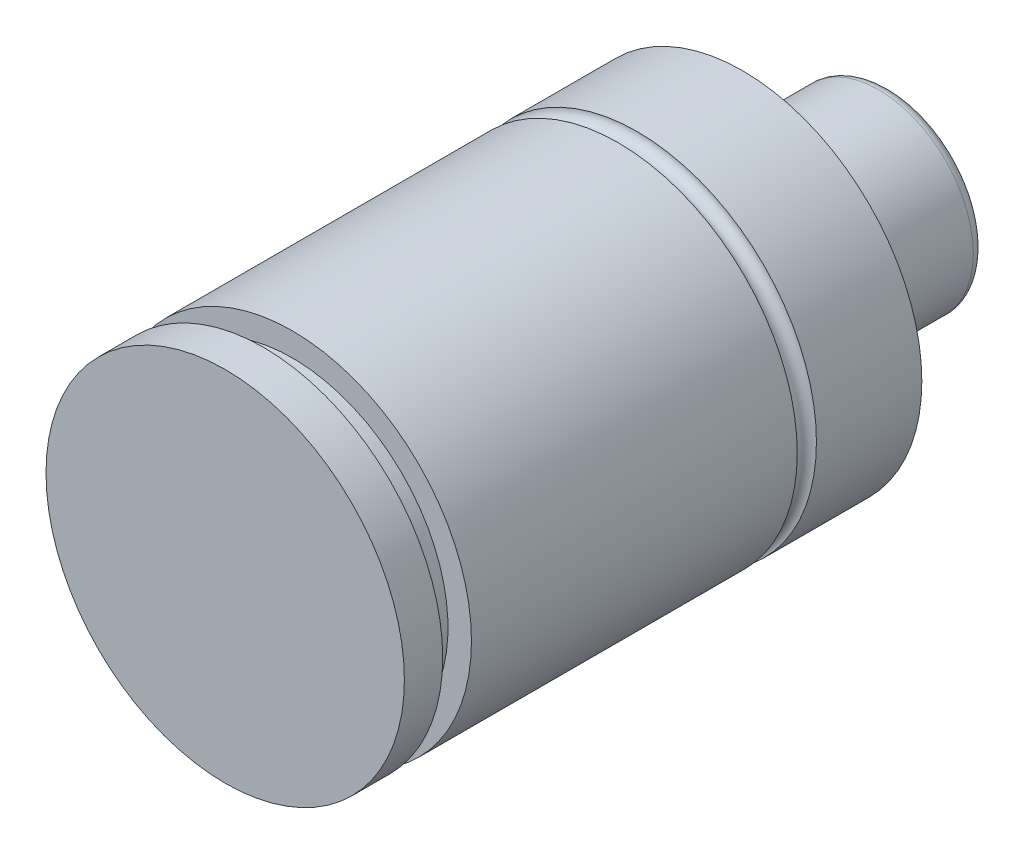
ISO-10303-21;
HEADER;
FILE_DESCRIPTION(('STEP AP214'),'2;1');
FILE_NAME('part.step','',(''),(''),'','','');
FILE_SCHEMA(('AUTOMOTIVE_DESIGN { 1 0 10303 214 1 1 1 1 }'));
ENDSEC;
DATA;
#1=APPLICATION_CONTEXT('core data for automotive mechanical design processes');
#2=APPLICATION_PROTOCOL_DEFINITION('international standard','automotive_design',2000,#1);
#3=PRODUCT_CONTEXT('',#1,'mechanical');
#4=PRODUCT('Part','Part','',(#3));
#5=PRODUCT_RELATED_PRODUCT_CATEGORY('part','',(#4));
#6=PRODUCT_DEFINITION_FORMATION('','',#4);
#7=PRODUCT_DEFINITION_CONTEXT('part definition',#1,'design');
#8=PRODUCT_DEFINITION('design','',#6,#7);
#9=PRODUCT_DEFINITION_SHAPE('','',#8);
#10=(LENGTH_UNIT() NAMED_UNIT(*) SI_UNIT(.MILLI.,.METRE.));
#11=(NAMED_UNIT(*) PLANE_ANGLE_UNIT() SI_UNIT($,.RADIAN.));
#12=(NAMED_UNIT(*) SI_UNIT($,.STERADIAN.) SOLID_ANGLE_UNIT());
#13=UNCERTAINTY_MEASURE_WITH_UNIT(LENGTH_MEASURE(1.E-05),#10,'distance_accuracy_value','');
#14=(GEOMETRIC_REPRESENTATION_CONTEXT(3) GLOBAL_UNCERTAINTY_ASSIGNED_CONTEXT((#13)) GLOBAL_UNIT_ASSIGNED_CONTEXT((#10,
#11,#12)) REPRESENTATION_CONTEXT('',''));
#15=CARTESIAN_POINT('',(0.,0.,0.));
#16=DIRECTION('',(0.,0.,1.));
#17=DIRECTION('',(1.,0.,0.));
#18=AXIS2_PLACEMENT_3D('',#15,#16,#17);
#19=CARTESIAN_POINT('',(0.,0.,-88.0737961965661));
#20=DIRECTION('',(0.,0.,-1.));
#21=DIRECTION('',(-1.,0.,0.));
#22=AXIS2_PLACEMENT_3D('',#19,#20,#21);
#23=CYLINDRICAL_SURFACE('',#22,10.033);
#24=CARTESIAN_POINT('',(0.,0.,-69.2912));
#25=DIRECTION('',(0.,0.,-1.));
#26=DIRECTION('',(-1.,0.,0.));
#27=AXIS2_PLACEMENT_3D('',#24,#25,#26);
#28=CIRCLE('',#27,10.033);
#29=CARTESIAN_POINT('',(-10.033,0.,-69.2912));
#30=VERTEX_POINT('',#29);
#31=EDGE_CURVE('E10',#30,#30,#28,.T.);
#32=ORIENTED_EDGE('',*,*,#31,.F.);
#33=EDGE_LOOP('',(#32));
#34=FACE_BOUND('',#33,.T.);
#35=CARTESIAN_POINT('',(0.,0.,-54.864));
#36=DIRECTION('',(0.,0.,-1.));
#37=DIRECTION('',(-1.,0.,0.));
#38=AXIS2_PLACEMENT_3D('',#35,#36,#37);
#39=CIRCLE('',#38,10.033);
#40=CARTESIAN_POINT('',(-10.033,0.,-54.864));
#41=VERTEX_POINT('',#40);
#42=EDGE_CURVE('E78',#41,#41,#39,.T.);
#43=ORIENTED_EDGE('',*,*,#42,.T.);
#44=EDGE_LOOP('',(#43));
#45=FACE_BOUND('',#44,.T.);
#46=ADVANCED_FACE('F41',(#34,#45),#23,.T.);
#47=CARTESIAN_POINT('',(0.,0.,-69.2912));
#48=DIRECTION('',(0.,0.,-1.));
#49=DIRECTION('',(-1.,0.,0.));
#50=AXIS2_PLACEMENT_3D('',#47,#48,#49);
#51=TOROIDAL_SURFACE('',#50,8.8392,1.19379999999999);
#52=CARTESIAN_POINT('',(0.,0.,-70.485));
#53=DIRECTION('',(0.,0.,-1.));
#54=DIRECTION('',(-1.,0.,0.));
#55=AXIS2_PLACEMENT_3D('',#52,#53,#54);
#56=CIRCLE('',#55,8.8392);
#57=CARTESIAN_POINT('',(-8.8392,0.,-70.485));
#58=VERTEX_POINT('',#57);
#59=EDGE_CURVE('E47',#58,#58,#56,.T.);
#60=ORIENTED_EDGE('',*,*,#59,.F.);
#61=EDGE_LOOP('',(#60));
#62=FACE_BOUND('',#61,.T.);
#63=ORIENTED_EDGE('',*,*,#31,.T.);
#64=EDGE_LOOP('',(#63));
#65=FACE_BOUND('',#64,.T.);
#66=ADVANCED_FACE('F138',(#62,#65),#51,.T.);
#67=CARTESIAN_POINT('',(-8.8392,0.,-70.485));
#68=DIRECTION('',(0.,0.,1.));
#69=DIRECTION('',(1.,0.,0.));
#70=AXIS2_PLACEMENT_3D('',#67,#68,#69);
#71=PLANE('',#70);
#72=ORIENTED_EDGE('',*,*,#59,.T.);
#73=EDGE_LOOP('',(#72));
#74=FACE_BOUND('',#73,.T.);
#75=ADVANCED_FACE('F133',(#74),#71,.F.);
#76=CARTESIAN_POINT('',(0.,0.,0.));
#77=DIRECTION('',(0.,0.,-1.));
#78=DIRECTION('',(-1.,0.,0.));
#79=AXIS2_PLACEMENT_3D('',#76,#77,#78);
#80=PLANE('',#79);
#81=CARTESIAN_POINT('',(0.,0.,0.));
#82=DIRECTION('',(0.,0.,-1.));
#83=DIRECTION('',(-1.,0.,0.));
#84=AXIS2_PLACEMENT_3D('',#81,#82,#83);
#85=CIRCLE('',#84,18.9992);
#86=CARTESIAN_POINT('',(-18.9992,0.,0.));
#87=VERTEX_POINT('',#86);
#88=EDGE_CURVE('E51',#87,#87,#85,.T.);
#89=ORIENTED_EDGE('',*,*,#88,.F.);
#90=EDGE_LOOP('',(#89));
#91=FACE_BOUND('',#90,.T.);
#92=ADVANCED_FACE('F128',(#91),#80,.F.);
#93=CARTESIAN_POINT('',(0.,0.,-88.0737961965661));
#94=DIRECTION('',(0.,0.,-1.));
#95=DIRECTION('',(-1.,0.,0.));
#96=AXIS2_PLACEMENT_3D('',#93,#94,#95);
#97=CYLINDRICAL_SURFACE('',#96,18.9992);
#98=CARTESIAN_POINT('',(0.,0.,-4.064));
#99=DIRECTION('',(0.,0.,-1.));
#100=DIRECTION('',(-1.,0.,0.));
#101=AXIS2_PLACEMENT_3D('',#98,#99,#100);
#102=CIRCLE('',#101,18.9992);
#103=CARTESIAN_POINT('',(-18.9992,0.,-4.064));
#104=VERTEX_POINT('',#103);
#105=EDGE_CURVE('E55',#104,#104,#102,.T.);
#106=ORIENTED_EDGE('',*,*,#105,.F.);
#107=EDGE_LOOP('',(#106));
#108=FACE_BOUND('',#107,.T.);
#109=ORIENTED_EDGE('',*,*,#88,.T.);
#110=EDGE_LOOP('',(#109));
#111=FACE_BOUND('',#110,.T.);
#112=ADVANCED_FACE('F122',(#108,#111),#97,.T.);
#113=CARTESIAN_POINT('',(-18.9992,0.,-4.064));
#114=DIRECTION('',(0.,0.,1.));
#115=DIRECTION('',(1.,0.,0.));
#116=AXIS2_PLACEMENT_3D('',#113,#114,#115);
#117=PLANE('',#116);
#118=CARTESIAN_POINT('',(0.,0.,-4.064));
#119=DIRECTION('',(0.,0.,-1.));
#120=DIRECTION('',(-1.,0.,0.));
#121=AXIS2_PLACEMENT_3D('',#118,#119,#120);
#122=CIRCLE('',#121,16.51);
#123=CARTESIAN_POINT('',(-16.51,0.,-4.064));
#124=VERTEX_POINT('',#123);
#125=EDGE_CURVE('E60',#124,#124,#122,.T.);
#126=ORIENTED_EDGE('',*,*,#125,.F.);
#127=EDGE_LOOP('',(#126));
#128=FACE_BOUND('',#127,.T.);
#129=ORIENTED_EDGE('',*,*,#105,.T.);
#130=EDGE_LOOP('',(#129));
#131=FACE_BOUND('',#130,.T.);
#132=ADVANCED_FACE('F116',(#128,#131),#117,.F.);
#133=CARTESIAN_POINT('',(0.,0.,-88.0737961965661));
#134=DIRECTION('',(0.,0.,-1.));
#135=DIRECTION('',(-1.,0.,0.));
#136=AXIS2_PLACEMENT_3D('',#133,#134,#135);
#137=CYLINDRICAL_SURFACE('',#136,16.51);
#138=CARTESIAN_POINT('',(0.,0.,-7.11200000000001));
#139=DIRECTION('',(0.,0.,-1.));
#140=DIRECTION('',(-1.,0.,0.));
#141=AXIS2_PLACEMENT_3D('',#138,#139,#140);
#142=CIRCLE('',#141,16.51);
#143=CARTESIAN_POINT('',(-16.51,0.,-7.11200000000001));
#144=VERTEX_POINT('',#143);
#145=EDGE_CURVE('E63',#144,#144,#142,.T.);
#146=ORIENTED_EDGE('',*,*,#145,.F.);
#147=EDGE_LOOP('',(#146));
#148=FACE_BOUND('',#147,.T.);
#149=ORIENTED_EDGE('',*,*,#125,.T.);
#150=EDGE_LOOP('',(#149));
#151=FACE_BOUND('',#150,.T.);
#152=ADVANCED_FACE('F110',(#148,#151),#137,.T.);
#153=CARTESIAN_POINT('',(-16.51,0.,-7.112));
#154=DIRECTION('',(0.,0.,-1.));
#155=DIRECTION('',(-1.,0.,0.));
#156=AXIS2_PLACEMENT_3D('',#153,#154,#155);
#157=PLANE('',#156);
#158=CARTESIAN_POINT('',(0.,0.,-7.11200000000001));
#159=DIRECTION('',(0.,0.,-1.));
#160=DIRECTION('',(-1.,0.,0.));
#161=AXIS2_PLACEMENT_3D('',#158,#159,#160);
#162=CIRCLE('',#161,18.9992);
#163=CARTESIAN_POINT('',(-18.9992,0.,-7.11200000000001));
#164=VERTEX_POINT('',#163);
#165=EDGE_CURVE('E66',#164,#164,#162,.T.);
#166=ORIENTED_EDGE('',*,*,#165,.F.);
#167=EDGE_LOOP('',(#166));
#168=FACE_BOUND('',#167,.T.);
#169=ORIENTED_EDGE('',*,*,#145,.T.);
#170=EDGE_LOOP('',(#169));
#171=FACE_BOUND('',#170,.T.);
#172=ADVANCED_FACE('F104',(#168,#171),#157,.F.);
#173=CARTESIAN_POINT('',(0.,0.,-88.0737961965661));
#174=DIRECTION('',(0.,0.,-1.));
#175=DIRECTION('',(-1.,0.,0.));
#176=AXIS2_PLACEMENT_3D('',#173,#174,#175);
#177=CYLINDRICAL_SURFACE('',#176,18.9992);
#178=CARTESIAN_POINT('',(0.,0.,-41.656));
#179=DIRECTION('',(0.,0.,-1.));
#180=DIRECTION('',(-1.,0.,0.));
#181=AXIS2_PLACEMENT_3D('',#178,#179,#180);
#182=CIRCLE('',#181,18.9992);
#183=CARTESIAN_POINT('',(-18.9992,0.,-41.656));
#184=VERTEX_POINT('',#183);
#185=EDGE_CURVE('E69',#184,#184,#182,.T.);
#186=ORIENTED_EDGE('',*,*,#185,.F.);
#187=EDGE_LOOP('',(#186));
#188=FACE_BOUND('',#187,.T.);
#189=ORIENTED_EDGE('',*,*,#165,.T.);
#190=EDGE_LOOP('',(#189));
#191=FACE_BOUND('',#190,.T.);
#192=ADVANCED_FACE('F98',(#188,#191),#177,.T.);
#193=CARTESIAN_POINT('',(0.,0.,-42.672));
#194=DIRECTION('',(0.,0.,-1.));
#195=DIRECTION('',(-1.,0.,0.));
#196=AXIS2_PLACEMENT_3D('',#193,#194,#195);
#197=TOROIDAL_SURFACE('',#196,18.9992,1.016);
#198=CARTESIAN_POINT('',(0.,0.,-43.688));
#199=DIRECTION('',(0.,0.,-1.));
#200=DIRECTION('',(-1.,0.,0.));
#201=AXIS2_PLACEMENT_3D('',#198,#199,#200);
#202=CIRCLE('',#201,18.9992);
#203=CARTESIAN_POINT('',(-18.9992,0.,-43.688));
#204=VERTEX_POINT('',#203);
#205=EDGE_CURVE('E72',#204,#204,#202,.T.);
#206=ORIENTED_EDGE('',*,*,#205,.F.);
#207=EDGE_LOOP('',(#206));
#208=FACE_BOUND('',#207,.T.);
#209=ORIENTED_EDGE('',*,*,#185,.T.);
#210=EDGE_LOOP('',(#209));
#211=FACE_BOUND('',#210,.T.);
#212=ADVANCED_FACE('F92',(#208,#211),#197,.F.);
#213=CARTESIAN_POINT('',(0.,0.,-88.0737961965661));
#214=DIRECTION('',(0.,0.,-1.));
#215=DIRECTION('',(-1.,0.,0.));
#216=AXIS2_PLACEMENT_3D('',#213,#214,#215);
#217=CYLINDRICAL_SURFACE('',#216,18.9992);
#218=CARTESIAN_POINT('',(0.,0.,-54.864));
#219=DIRECTION('',(0.,0.,-1.));
#220=DIRECTION('',(-1.,0.,0.));
#221=AXIS2_PLACEMENT_3D('',#218,#219,#220);
#222=CIRCLE('',#221,18.9992);
#223=CARTESIAN_POINT('',(-18.9992,0.,-54.864));
#224=VERTEX_POINT('',#223);
#225=EDGE_CURVE('E75',#224,#224,#222,.T.);
#226=ORIENTED_EDGE('',*,*,#225,.F.);
#227=EDGE_LOOP('',(#226));
#228=FACE_BOUND('',#227,.T.);
#229=ORIENTED_EDGE('',*,*,#205,.T.);
#230=EDGE_LOOP('',(#229));
#231=FACE_BOUND('',#230,.T.);
#232=ADVANCED_FACE('F86',(#228,#231),#217,.T.);
#233=CARTESIAN_POINT('',(-10.033,0.,-54.864));
#234=DIRECTION('',(0.,0.,1.));
#235=DIRECTION('',(1.,0.,0.));
#236=AXIS2_PLACEMENT_3D('',#233,#234,#235);
#237=PLANE('',#236);
#238=ORIENTED_EDGE('',*,*,#42,.F.);
#239=EDGE_LOOP('',(#238));
#240=FACE_BOUND('',#239,.T.);
#241=ORIENTED_EDGE('',*,*,#225,.T.);
#242=EDGE_LOOP('',(#241));
#243=FACE_BOUND('',#242,.T.);
#244=ADVANCED_FACE('F83',(#240,#243),#237,.F.);
#245=CLOSED_SHELL('',(#46,#66,#75,#92,#112,#132,#152,#172,#192,#212,#232,#244));
#246=MANIFOLD_SOLID_BREP('B2',#245);
#247=ADVANCED_BREP_SHAPE_REPRESENTATION('',(#18,#246),#14);
#248=SHAPE_DEFINITION_REPRESENTATION(#9,#247);
ENDSEC;
END-ISO-10303-21;
